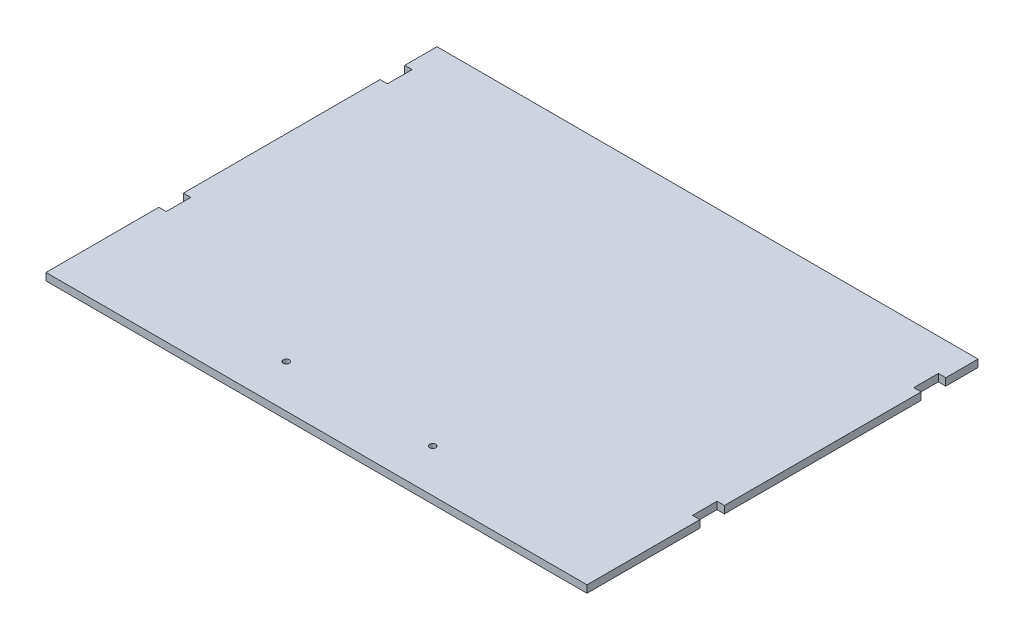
ISO-10303-21;
HEADER;
FILE_DESCRIPTION(('STEP AP214'),'2;1');
FILE_NAME('part.step','',(''),(''),'','','');
FILE_SCHEMA(('AUTOMOTIVE_DESIGN { 1 0 10303 214 1 1 1 1 }'));
ENDSEC;
DATA;
#1=APPLICATION_CONTEXT('core data for automotive mechanical design processes');
#2=APPLICATION_PROTOCOL_DEFINITION('international standard','automotive_design',2000,#1);
#3=PRODUCT_CONTEXT('',#1,'mechanical');
#4=PRODUCT('Part','Part','',(#3));
#5=PRODUCT_RELATED_PRODUCT_CATEGORY('part','',(#4));
#6=PRODUCT_DEFINITION_FORMATION('','',#4);
#7=PRODUCT_DEFINITION_CONTEXT('part definition',#1,'design');
#8=PRODUCT_DEFINITION('design','',#6,#7);
#9=PRODUCT_DEFINITION_SHAPE('','',#8);
#10=(LENGTH_UNIT() NAMED_UNIT(*) SI_UNIT(.MILLI.,.METRE.));
#11=(NAMED_UNIT(*) PLANE_ANGLE_UNIT() SI_UNIT($,.RADIAN.));
#12=(NAMED_UNIT(*) SI_UNIT($,.STERADIAN.) SOLID_ANGLE_UNIT());
#13=UNCERTAINTY_MEASURE_WITH_UNIT(LENGTH_MEASURE(1.E-05),#10,'distance_accuracy_value','');
#14=(GEOMETRIC_REPRESENTATION_CONTEXT(3) GLOBAL_UNCERTAINTY_ASSIGNED_CONTEXT((#13)) GLOBAL_UNIT_ASSIGNED_CONTEXT((#10,
#11,#12)) REPRESENTATION_CONTEXT('',''));
#15=CARTESIAN_POINT('',(0.,0.,0.));
#16=DIRECTION('',(0.,0.,1.));
#17=DIRECTION('',(1.,0.,0.));
#18=AXIS2_PLACEMENT_3D('',#15,#16,#17);
#19=CARTESIAN_POINT('',(0.,6.,0.));
#20=DIRECTION('',(0.,1.,0.));
#21=DIRECTION('',(0.,0.,1.));
#22=AXIS2_PLACEMENT_3D('',#19,#20,#21);
#23=PLANE('',#22);
#24=CARTESIAN_POINT('',(-59.5,6.,124.));
#25=DIRECTION('',(0.,1.,0.));
#26=DIRECTION('',(0.,0.,1.));
#27=AXIS2_PLACEMENT_3D('',#24,#25,#26);
#28=CIRCLE('',#27,2.5);
#29=CARTESIAN_POINT('',(-59.5,6.,126.5));
#30=VERTEX_POINT('',#29);
#31=EDGE_CURVE('E206',#30,#30,#28,.T.);
#32=ORIENTED_EDGE('',*,*,#31,.F.);
#33=EDGE_LOOP('',(#32));
#34=FACE_BOUND('',#33,.T.);
#35=DIRECTION('',(0.,0.,1.));
#36=VECTOR('',#35,1.);
#37=CARTESIAN_POINT('',(-220.,6.,-159.));
#38=LINE('',#37,#36);
#39=CARTESIAN_POINT('',(-220.,6.,-159.));
#40=VERTEX_POINT('',#39);
#41=CARTESIAN_POINT('',(-220.,6.,-132.75));
#42=VERTEX_POINT('',#41);
#43=EDGE_CURVE('E241',#40,#42,#38,.T.);
#44=ORIENTED_EDGE('',*,*,#43,.T.);
#45=DIRECTION('',(1.,0.,0.));
#46=VECTOR('',#45,1.);
#47=CARTESIAN_POINT('',(-220.,6.,-132.75));
#48=LINE('',#47,#46);
#49=CARTESIAN_POINT('',(-214.,6.,-132.75));
#50=VERTEX_POINT('',#49);
#51=EDGE_CURVE('E129',#42,#50,#48,.T.);
#52=ORIENTED_EDGE('',*,*,#51,.T.);
#53=DIRECTION('',(0.,0.,1.));
#54=VECTOR('',#53,1.);
#55=CARTESIAN_POINT('',(-214.,6.,-132.75));
#56=LINE('',#55,#54);
#57=CARTESIAN_POINT('',(-214.,6.,-112.75));
#58=VERTEX_POINT('',#57);
#59=EDGE_CURVE('E292',#50,#58,#56,.T.);
#60=ORIENTED_EDGE('',*,*,#59,.T.);
#61=DIRECTION('',(-1.,0.,0.));
#62=VECTOR('',#61,1.);
#63=CARTESIAN_POINT('',(-220.,6.,-112.75));
#64=LINE('',#63,#62);
#65=CARTESIAN_POINT('',(-220.,6.,-112.75));
#66=VERTEX_POINT('',#65);
#67=EDGE_CURVE('E311',#58,#66,#64,.T.);
#68=ORIENTED_EDGE('',*,*,#67,.T.);
#69=DIRECTION('',(0.,0.,1.));
#70=VECTOR('',#69,1.);
#71=CARTESIAN_POINT('',(-220.,6.,-112.75));
#72=LINE('',#71,#70);
#73=CARTESIAN_POINT('',(-220.,6.,47.25));
#74=VERTEX_POINT('',#73);
#75=EDGE_CURVE('E308',#66,#74,#72,.T.);
#76=ORIENTED_EDGE('',*,*,#75,.T.);
#77=DIRECTION('',(1.,0.,0.));
#78=VECTOR('',#77,1.);
#79=CARTESIAN_POINT('',(-220.,6.,47.25));
#80=LINE('',#79,#78);
#81=CARTESIAN_POINT('',(-214.,6.,47.25));
#82=VERTEX_POINT('',#81);
#83=EDGE_CURVE('E310',#74,#82,#80,.T.);
#84=ORIENTED_EDGE('',*,*,#83,.T.);
#85=DIRECTION('',(0.,0.,1.));
#86=VECTOR('',#85,1.);
#87=CARTESIAN_POINT('',(-214.,6.,47.25));
#88=LINE('',#87,#86);
#89=CARTESIAN_POINT('',(-214.,6.,67.25));
#90=VERTEX_POINT('',#89);
#91=EDGE_CURVE('E313',#82,#90,#88,.T.);
#92=ORIENTED_EDGE('',*,*,#91,.T.);
#93=DIRECTION('',(-1.,0.,0.));
#94=VECTOR('',#93,1.);
#95=CARTESIAN_POINT('',(-220.,6.,67.25));
#96=LINE('',#95,#94);
#97=CARTESIAN_POINT('',(-220.,6.,67.25));
#98=VERTEX_POINT('',#97);
#99=EDGE_CURVE('E319',#90,#98,#96,.T.);
#100=ORIENTED_EDGE('',*,*,#99,.T.);
#101=DIRECTION('',(0.,0.,1.));
#102=VECTOR('',#101,1.);
#103=CARTESIAN_POINT('',(-220.,6.,67.25));
#104=LINE('',#103,#102);
#105=CARTESIAN_POINT('',(-220.,6.,159.));
#106=VERTEX_POINT('',#105);
#107=EDGE_CURVE('E321',#98,#106,#104,.T.);
#108=ORIENTED_EDGE('',*,*,#107,.T.);
#109=DIRECTION('',(1.,0.,0.));
#110=VECTOR('',#109,1.);
#111=CARTESIAN_POINT('',(-220.,6.,159.));
#112=LINE('',#111,#110);
#113=CARTESIAN_POINT('',(220.,6.,159.));
#114=VERTEX_POINT('',#113);
#115=EDGE_CURVE('E323',#106,#114,#112,.T.);
#116=ORIENTED_EDGE('',*,*,#115,.T.);
#117=DIRECTION('',(0.,0.,-1.));
#118=VECTOR('',#117,1.);
#119=CARTESIAN_POINT('',(220.,6.,67.25));
#120=LINE('',#119,#118);
#121=CARTESIAN_POINT('',(220.,6.,67.25));
#122=VERTEX_POINT('',#121);
#123=EDGE_CURVE('E325',#114,#122,#120,.T.);
#124=ORIENTED_EDGE('',*,*,#123,.T.);
#125=DIRECTION('',(-1.,0.,0.));
#126=VECTOR('',#125,1.);
#127=CARTESIAN_POINT('',(220.,6.,67.25));
#128=LINE('',#127,#126);
#129=CARTESIAN_POINT('',(214.,6.,67.25));
#130=VERTEX_POINT('',#129);
#131=EDGE_CURVE('E327',#122,#130,#128,.T.);
#132=ORIENTED_EDGE('',*,*,#131,.T.);
#133=DIRECTION('',(0.,0.,-1.));
#134=VECTOR('',#133,1.);
#135=CARTESIAN_POINT('',(214.,6.,47.25));
#136=LINE('',#135,#134);
#137=CARTESIAN_POINT('',(214.,6.,47.25));
#138=VERTEX_POINT('',#137);
#139=EDGE_CURVE('E329',#130,#138,#136,.T.);
#140=ORIENTED_EDGE('',*,*,#139,.T.);
#141=DIRECTION('',(1.,0.,0.));
#142=VECTOR('',#141,1.);
#143=CARTESIAN_POINT('',(220.,6.,47.25));
#144=LINE('',#143,#142);
#145=CARTESIAN_POINT('',(220.,6.,47.25));
#146=VERTEX_POINT('',#145);
#147=EDGE_CURVE('E331',#138,#146,#144,.T.);
#148=ORIENTED_EDGE('',*,*,#147,.T.);
#149=DIRECTION('',(0.,0.,-1.));
#150=VECTOR('',#149,1.);
#151=CARTESIAN_POINT('',(220.,6.,-112.75));
#152=LINE('',#151,#150);
#153=CARTESIAN_POINT('',(220.,6.,-112.75));
#154=VERTEX_POINT('',#153);
#155=EDGE_CURVE('E333',#146,#154,#152,.T.);
#156=ORIENTED_EDGE('',*,*,#155,.T.);
#157=DIRECTION('',(-1.,0.,0.));
#158=VECTOR('',#157,1.);
#159=CARTESIAN_POINT('',(220.,6.,-112.75));
#160=LINE('',#159,#158);
#161=CARTESIAN_POINT('',(214.,6.,-112.75));
#162=VERTEX_POINT('',#161);
#163=EDGE_CURVE('E335',#154,#162,#160,.T.);
#164=ORIENTED_EDGE('',*,*,#163,.T.);
#165=DIRECTION('',(0.,0.,-1.));
#166=VECTOR('',#165,1.);
#167=CARTESIAN_POINT('',(214.,6.,-132.75));
#168=LINE('',#167,#166);
#169=CARTESIAN_POINT('',(214.,6.,-132.75));
#170=VERTEX_POINT('',#169);
#171=EDGE_CURVE('E184',#162,#170,#168,.T.);
#172=ORIENTED_EDGE('',*,*,#171,.T.);
#173=DIRECTION('',(1.,0.,0.));
#174=VECTOR('',#173,1.);
#175=CARTESIAN_POINT('',(220.,6.,-132.75));
#176=LINE('',#175,#174);
#177=CARTESIAN_POINT('',(220.,6.,-132.75));
#178=VERTEX_POINT('',#177);
#179=EDGE_CURVE('E178',#170,#178,#176,.T.);
#180=ORIENTED_EDGE('',*,*,#179,.T.);
#181=DIRECTION('',(0.,0.,-1.));
#182=VECTOR('',#181,1.);
#183=CARTESIAN_POINT('',(220.,6.,-159.));
#184=LINE('',#183,#182);
#185=CARTESIAN_POINT('',(220.,6.,-159.));
#186=VERTEX_POINT('',#185);
#187=EDGE_CURVE('E182',#178,#186,#184,.T.);
#188=ORIENTED_EDGE('',*,*,#187,.T.);
#189=DIRECTION('',(-1.,0.,0.));
#190=VECTOR('',#189,1.);
#191=CARTESIAN_POINT('',(-220.,6.,-159.));
#192=LINE('',#191,#190);
#193=EDGE_CURVE('E50',#186,#40,#192,.T.);
#194=ORIENTED_EDGE('',*,*,#193,.T.);
#195=EDGE_LOOP('',(#44,#52,#60,#68,#76,#84,#92,#100,#108,#116,#124,#132,#140,#148,#156,#164,
#172,#180,#188,#194));
#196=FACE_BOUND('',#195,.T.);
#197=CARTESIAN_POINT('',(59.5,6.,124.));
#198=DIRECTION('',(0.,1.,0.));
#199=DIRECTION('',(0.,0.,-1.));
#200=AXIS2_PLACEMENT_3D('',#197,#198,#199);
#201=CIRCLE('',#200,2.5);
#202=CARTESIAN_POINT('',(59.5,6.,121.5));
#203=VERTEX_POINT('',#202);
#204=EDGE_CURVE('E378',#203,#203,#201,.T.);
#205=ORIENTED_EDGE('',*,*,#204,.F.);
#206=EDGE_LOOP('',(#205));
#207=FACE_BOUND('',#206,.T.);
#208=ADVANCED_FACE('F33',(#34,#196,#207),#23,.T.);
#209=CARTESIAN_POINT('',(0.,0.,0.));
#210=DIRECTION('',(0.,1.,0.));
#211=DIRECTION('',(0.,0.,1.));
#212=AXIS2_PLACEMENT_3D('',#209,#210,#211);
#213=PLANE('',#212);
#214=CARTESIAN_POINT('',(-59.5,0.,124.));
#215=DIRECTION('',(0.,1.,0.));
#216=DIRECTION('',(0.,0.,1.));
#217=AXIS2_PLACEMENT_3D('',#214,#215,#216);
#218=CIRCLE('',#217,2.5);
#219=CARTESIAN_POINT('',(-59.5,0.,126.5));
#220=VERTEX_POINT('',#219);
#221=EDGE_CURVE('E383',#220,#220,#218,.T.);
#222=ORIENTED_EDGE('',*,*,#221,.T.);
#223=EDGE_LOOP('',(#222));
#224=FACE_BOUND('',#223,.T.);
#225=DIRECTION('',(0.,0.,1.));
#226=VECTOR('',#225,1.);
#227=CARTESIAN_POINT('',(-220.,0.,-159.));
#228=LINE('',#227,#226);
#229=CARTESIAN_POINT('',(-220.,0.,-159.));
#230=VERTEX_POINT('',#229);
#231=CARTESIAN_POINT('',(-220.,0.,-132.75));
#232=VERTEX_POINT('',#231);
#233=EDGE_CURVE('E202',#230,#232,#228,.T.);
#234=ORIENTED_EDGE('',*,*,#233,.F.);
#235=DIRECTION('',(-1.,0.,0.));
#236=VECTOR('',#235,1.);
#237=CARTESIAN_POINT('',(-220.,0.,-159.));
#238=LINE('',#237,#236);
#239=CARTESIAN_POINT('',(220.,0.,-159.));
#240=VERTEX_POINT('',#239);
#241=EDGE_CURVE('E121',#240,#230,#238,.T.);
#242=ORIENTED_EDGE('',*,*,#241,.F.);
#243=DIRECTION('',(0.,0.,-1.));
#244=VECTOR('',#243,1.);
#245=CARTESIAN_POINT('',(220.,0.,-159.));
#246=LINE('',#245,#244);
#247=CARTESIAN_POINT('',(220.,0.,-132.75));
#248=VERTEX_POINT('',#247);
#249=EDGE_CURVE('E115',#248,#240,#246,.T.);
#250=ORIENTED_EDGE('',*,*,#249,.F.);
#251=DIRECTION('',(1.,0.,0.));
#252=VECTOR('',#251,1.);
#253=CARTESIAN_POINT('',(220.,0.,-132.75));
#254=LINE('',#253,#252);
#255=CARTESIAN_POINT('',(214.,0.,-132.75));
#256=VERTEX_POINT('',#255);
#257=EDGE_CURVE('E192',#256,#248,#254,.T.);
#258=ORIENTED_EDGE('',*,*,#257,.F.);
#259=DIRECTION('',(0.,0.,-1.));
#260=VECTOR('',#259,1.);
#261=CARTESIAN_POINT('',(214.,0.,-132.75));
#262=LINE('',#261,#260);
#263=CARTESIAN_POINT('',(214.,0.,-112.75));
#264=VERTEX_POINT('',#263);
#265=EDGE_CURVE('E236',#264,#256,#262,.T.);
#266=ORIENTED_EDGE('',*,*,#265,.F.);
#267=DIRECTION('',(-1.,0.,0.));
#268=VECTOR('',#267,1.);
#269=CARTESIAN_POINT('',(220.,0.,-112.75));
#270=LINE('',#269,#268);
#271=CARTESIAN_POINT('',(220.,0.,-112.75));
#272=VERTEX_POINT('',#271);
#273=EDGE_CURVE('E234',#272,#264,#270,.T.);
#274=ORIENTED_EDGE('',*,*,#273,.F.);
#275=DIRECTION('',(0.,0.,-1.));
#276=VECTOR('',#275,1.);
#277=CARTESIAN_POINT('',(220.,0.,-112.75));
#278=LINE('',#277,#276);
#279=CARTESIAN_POINT('',(220.,0.,47.25));
#280=VERTEX_POINT('',#279);
#281=EDGE_CURVE('E232',#280,#272,#278,.T.);
#282=ORIENTED_EDGE('',*,*,#281,.F.);
#283=DIRECTION('',(1.,0.,0.));
#284=VECTOR('',#283,1.);
#285=CARTESIAN_POINT('',(220.,0.,47.25));
#286=LINE('',#285,#284);
#287=CARTESIAN_POINT('',(214.,0.,47.25));
#288=VERTEX_POINT('',#287);
#289=EDGE_CURVE('E230',#288,#280,#286,.T.);
#290=ORIENTED_EDGE('',*,*,#289,.F.);
#291=DIRECTION('',(0.,0.,-1.));
#292=VECTOR('',#291,1.);
#293=CARTESIAN_POINT('',(214.,0.,47.25));
#294=LINE('',#293,#292);
#295=CARTESIAN_POINT('',(214.,0.,67.25));
#296=VERTEX_POINT('',#295);
#297=EDGE_CURVE('E228',#296,#288,#294,.T.);
#298=ORIENTED_EDGE('',*,*,#297,.F.);
#299=DIRECTION('',(-1.,0.,0.));
#300=VECTOR('',#299,1.);
#301=CARTESIAN_POINT('',(220.,0.,67.25));
#302=LINE('',#301,#300);
#303=CARTESIAN_POINT('',(220.,0.,67.25));
#304=VERTEX_POINT('',#303);
#305=EDGE_CURVE('E226',#304,#296,#302,.T.);
#306=ORIENTED_EDGE('',*,*,#305,.F.);
#307=DIRECTION('',(0.,0.,-1.));
#308=VECTOR('',#307,1.);
#309=CARTESIAN_POINT('',(220.,0.,67.25));
#310=LINE('',#309,#308);
#311=CARTESIAN_POINT('',(220.,0.,159.));
#312=VERTEX_POINT('',#311);
#313=EDGE_CURVE('E224',#312,#304,#310,.T.);
#314=ORIENTED_EDGE('',*,*,#313,.F.);
#315=DIRECTION('',(1.,0.,0.));
#316=VECTOR('',#315,1.);
#317=CARTESIAN_POINT('',(-220.,0.,159.));
#318=LINE('',#317,#316);
#319=CARTESIAN_POINT('',(-220.,0.,159.));
#320=VERTEX_POINT('',#319);
#321=EDGE_CURVE('E222',#320,#312,#318,.T.);
#322=ORIENTED_EDGE('',*,*,#321,.F.);
#323=DIRECTION('',(0.,0.,1.));
#324=VECTOR('',#323,1.);
#325=CARTESIAN_POINT('',(-220.,0.,67.25));
#326=LINE('',#325,#324);
#327=CARTESIAN_POINT('',(-220.,0.,67.25));
#328=VERTEX_POINT('',#327);
#329=EDGE_CURVE('E220',#328,#320,#326,.T.);
#330=ORIENTED_EDGE('',*,*,#329,.F.);
#331=DIRECTION('',(-1.,0.,0.));
#332=VECTOR('',#331,1.);
#333=CARTESIAN_POINT('',(-220.,0.,67.25));
#334=LINE('',#333,#332);
#335=CARTESIAN_POINT('',(-214.,0.,67.25));
#336=VERTEX_POINT('',#335);
#337=EDGE_CURVE('E218',#336,#328,#334,.T.);
#338=ORIENTED_EDGE('',*,*,#337,.F.);
#339=DIRECTION('',(0.,0.,1.));
#340=VECTOR('',#339,1.);
#341=CARTESIAN_POINT('',(-214.,0.,47.25));
#342=LINE('',#341,#340);
#343=CARTESIAN_POINT('',(-214.,0.,47.25));
#344=VERTEX_POINT('',#343);
#345=EDGE_CURVE('E216',#344,#336,#342,.T.);
#346=ORIENTED_EDGE('',*,*,#345,.F.);
#347=DIRECTION('',(1.,0.,0.));
#348=VECTOR('',#347,1.);
#349=CARTESIAN_POINT('',(-220.,0.,47.25));
#350=LINE('',#349,#348);
#351=CARTESIAN_POINT('',(-220.,0.,47.25));
#352=VERTEX_POINT('',#351);
#353=EDGE_CURVE('E214',#352,#344,#350,.T.);
#354=ORIENTED_EDGE('',*,*,#353,.F.);
#355=DIRECTION('',(0.,0.,1.));
#356=VECTOR('',#355,1.);
#357=CARTESIAN_POINT('',(-220.,0.,-112.75));
#358=LINE('',#357,#356);
#359=CARTESIAN_POINT('',(-220.,0.,-112.75));
#360=VERTEX_POINT('',#359);
#361=EDGE_CURVE('E212',#360,#352,#358,.T.);
#362=ORIENTED_EDGE('',*,*,#361,.F.);
#363=DIRECTION('',(-1.,0.,0.));
#364=VECTOR('',#363,1.);
#365=CARTESIAN_POINT('',(-220.,0.,-112.75));
#366=LINE('',#365,#364);
#367=CARTESIAN_POINT('',(-214.,0.,-112.75));
#368=VERTEX_POINT('',#367);
#369=EDGE_CURVE('E210',#368,#360,#366,.T.);
#370=ORIENTED_EDGE('',*,*,#369,.F.);
#371=DIRECTION('',(0.,0.,1.));
#372=VECTOR('',#371,1.);
#373=CARTESIAN_POINT('',(-214.,0.,-132.75));
#374=LINE('',#373,#372);
#375=CARTESIAN_POINT('',(-214.,0.,-132.75));
#376=VERTEX_POINT('',#375);
#377=EDGE_CURVE('E208',#376,#368,#374,.T.);
#378=ORIENTED_EDGE('',*,*,#377,.F.);
#379=DIRECTION('',(1.,0.,0.));
#380=VECTOR('',#379,1.);
#381=CARTESIAN_POINT('',(-220.,0.,-132.75));
#382=LINE('',#381,#380);
#383=EDGE_CURVE('E205',#232,#376,#382,.T.);
#384=ORIENTED_EDGE('',*,*,#383,.F.);
#385=EDGE_LOOP('',(#234,#242,#250,#258,#266,#274,#282,#290,#298,#306,#314,#322,#330,#338,#346,
#354,#362,#370,#378,#384));
#386=FACE_BOUND('',#385,.T.);
#387=CARTESIAN_POINT('',(59.5,0.,124.));
#388=DIRECTION('',(0.,1.,0.));
#389=DIRECTION('',(0.,0.,-1.));
#390=AXIS2_PLACEMENT_3D('',#387,#388,#389);
#391=CIRCLE('',#390,2.5);
#392=CARTESIAN_POINT('',(59.5,0.,121.5));
#393=VERTEX_POINT('',#392);
#394=EDGE_CURVE('E381',#393,#393,#391,.T.);
#395=ORIENTED_EDGE('',*,*,#394,.T.);
#396=EDGE_LOOP('',(#395));
#397=FACE_BOUND('',#396,.T.);
#398=ADVANCED_FACE('F296',(#224,#386,#397),#213,.F.);
#399=CARTESIAN_POINT('',(-220.,6.,-159.));
#400=DIRECTION('',(1.,0.,0.));
#401=DIRECTION('',(0.,0.,-1.));
#402=AXIS2_PLACEMENT_3D('',#399,#400,#401);
#403=PLANE('',#402);
#404=ORIENTED_EDGE('',*,*,#233,.T.);
#405=DIRECTION('',(0.,-1.,0.));
#406=VECTOR('',#405,1.);
#407=CARTESIAN_POINT('',(-220.,6.,-132.75));
#408=LINE('',#407,#406);
#409=EDGE_CURVE('E11',#42,#232,#408,.T.);
#410=ORIENTED_EDGE('',*,*,#409,.F.);
#411=ORIENTED_EDGE('',*,*,#43,.F.);
#412=DIRECTION('',(0.,-1.,0.));
#413=VECTOR('',#412,1.);
#414=CARTESIAN_POINT('',(-220.,6.,-159.));
#415=LINE('',#414,#413);
#416=EDGE_CURVE('E198',#40,#230,#415,.T.);
#417=ORIENTED_EDGE('',*,*,#416,.T.);
#418=EDGE_LOOP('',(#404,#410,#411,#417));
#419=FACE_BOUND('',#418,.T.);
#420=ADVANCED_FACE('F35',(#419),#403,.F.);
#421=CARTESIAN_POINT('',(-220.,6.,-132.75));
#422=DIRECTION('',(0.,0.,-1.));
#423=DIRECTION('',(-1.,0.,0.));
#424=AXIS2_PLACEMENT_3D('',#421,#422,#423);
#425=PLANE('',#424);
#426=ORIENTED_EDGE('',*,*,#383,.T.);
#427=DIRECTION('',(0.,-1.,0.));
#428=VECTOR('',#427,1.);
#429=CARTESIAN_POINT('',(-214.,6.,-132.75));
#430=LINE('',#429,#428);
#431=EDGE_CURVE('E42',#50,#376,#430,.T.);
#432=ORIENTED_EDGE('',*,*,#431,.F.);
#433=ORIENTED_EDGE('',*,*,#51,.F.);
#434=ORIENTED_EDGE('',*,*,#409,.T.);
#435=EDGE_LOOP('',(#426,#432,#433,#434));
#436=FACE_BOUND('',#435,.T.);
#437=ADVANCED_FACE('F556',(#436),#425,.F.);
#438=CARTESIAN_POINT('',(-214.,6.,-132.75));
#439=DIRECTION('',(1.,0.,0.));
#440=DIRECTION('',(0.,0.,-1.));
#441=AXIS2_PLACEMENT_3D('',#438,#439,#440);
#442=PLANE('',#441);
#443=ORIENTED_EDGE('',*,*,#377,.T.);
#444=DIRECTION('',(0.,-1.,0.));
#445=VECTOR('',#444,1.);
#446=CARTESIAN_POINT('',(-214.,6.,-112.75));
#447=LINE('',#446,#445);
#448=EDGE_CURVE('E284',#58,#368,#447,.T.);
#449=ORIENTED_EDGE('',*,*,#448,.F.);
#450=ORIENTED_EDGE('',*,*,#59,.F.);
#451=ORIENTED_EDGE('',*,*,#431,.T.);
#452=EDGE_LOOP('',(#443,#449,#450,#451));
#453=FACE_BOUND('',#452,.T.);
#454=ADVANCED_FACE('F290',(#453),#442,.F.);
#455=CARTESIAN_POINT('',(-220.,6.,-112.75));
#456=DIRECTION('',(0.,0.,1.));
#457=DIRECTION('',(1.,0.,0.));
#458=AXIS2_PLACEMENT_3D('',#455,#456,#457);
#459=PLANE('',#458);
#460=ORIENTED_EDGE('',*,*,#369,.T.);
#461=DIRECTION('',(0.,-1.,0.));
#462=VECTOR('',#461,1.);
#463=CARTESIAN_POINT('',(-220.,6.,-112.75));
#464=LINE('',#463,#462);
#465=EDGE_CURVE('E281',#66,#360,#464,.T.);
#466=ORIENTED_EDGE('',*,*,#465,.F.);
#467=ORIENTED_EDGE('',*,*,#67,.F.);
#468=ORIENTED_EDGE('',*,*,#448,.T.);
#469=EDGE_LOOP('',(#460,#466,#467,#468));
#470=FACE_BOUND('',#469,.T.);
#471=ADVANCED_FACE('F302',(#470),#459,.F.);
#472=CARTESIAN_POINT('',(-220.,6.,-112.75));
#473=DIRECTION('',(1.,0.,0.));
#474=DIRECTION('',(0.,0.,-1.));
#475=AXIS2_PLACEMENT_3D('',#472,#473,#474);
#476=PLANE('',#475);
#477=ORIENTED_EDGE('',*,*,#361,.T.);
#478=DIRECTION('',(0.,-1.,0.));
#479=VECTOR('',#478,1.);
#480=CARTESIAN_POINT('',(-220.,6.,47.25));
#481=LINE('',#480,#479);
#482=EDGE_CURVE('E278',#74,#352,#481,.T.);
#483=ORIENTED_EDGE('',*,*,#482,.F.);
#484=ORIENTED_EDGE('',*,*,#75,.F.);
#485=ORIENTED_EDGE('',*,*,#465,.T.);
#486=EDGE_LOOP('',(#477,#483,#484,#485));
#487=FACE_BOUND('',#486,.T.);
#488=ADVANCED_FACE('F306',(#487),#476,.F.);
#489=CARTESIAN_POINT('',(-220.,6.,47.25));
#490=DIRECTION('',(0.,0.,-1.));
#491=DIRECTION('',(-1.,0.,0.));
#492=AXIS2_PLACEMENT_3D('',#489,#490,#491);
#493=PLANE('',#492);
#494=ORIENTED_EDGE('',*,*,#353,.T.);
#495=DIRECTION('',(0.,-1.,0.));
#496=VECTOR('',#495,1.);
#497=CARTESIAN_POINT('',(-214.,6.,47.25));
#498=LINE('',#497,#496);
#499=EDGE_CURVE('E275',#82,#344,#498,.T.);
#500=ORIENTED_EDGE('',*,*,#499,.F.);
#501=ORIENTED_EDGE('',*,*,#83,.F.);
#502=ORIENTED_EDGE('',*,*,#482,.T.);
#503=EDGE_LOOP('',(#494,#500,#501,#502));
#504=FACE_BOUND('',#503,.T.);
#505=ADVANCED_FACE('F521',(#504),#493,.F.);
#506=CARTESIAN_POINT('',(-214.,6.,47.25));
#507=DIRECTION('',(1.,0.,0.));
#508=DIRECTION('',(0.,0.,-1.));
#509=AXIS2_PLACEMENT_3D('',#506,#507,#508);
#510=PLANE('',#509);
#511=ORIENTED_EDGE('',*,*,#345,.T.);
#512=DIRECTION('',(0.,-1.,0.));
#513=VECTOR('',#512,1.);
#514=CARTESIAN_POINT('',(-214.,6.,67.25));
#515=LINE('',#514,#513);
#516=EDGE_CURVE('E272',#90,#336,#515,.T.);
#517=ORIENTED_EDGE('',*,*,#516,.F.);
#518=ORIENTED_EDGE('',*,*,#91,.F.);
#519=ORIENTED_EDGE('',*,*,#499,.T.);
#520=EDGE_LOOP('',(#511,#517,#518,#519));
#521=FACE_BOUND('',#520,.T.);
#522=ADVANCED_FACE('F511',(#521),#510,.F.);
#523=CARTESIAN_POINT('',(-220.,6.,67.25));
#524=DIRECTION('',(0.,0.,1.));
#525=DIRECTION('',(1.,0.,0.));
#526=AXIS2_PLACEMENT_3D('',#523,#524,#525);
#527=PLANE('',#526);
#528=ORIENTED_EDGE('',*,*,#337,.T.);
#529=DIRECTION('',(0.,-1.,0.));
#530=VECTOR('',#529,1.);
#531=CARTESIAN_POINT('',(-220.,6.,67.25));
#532=LINE('',#531,#530);
#533=EDGE_CURVE('E269',#98,#328,#532,.T.);
#534=ORIENTED_EDGE('',*,*,#533,.F.);
#535=ORIENTED_EDGE('',*,*,#99,.F.);
#536=ORIENTED_EDGE('',*,*,#516,.T.);
#537=EDGE_LOOP('',(#528,#534,#535,#536));
#538=FACE_BOUND('',#537,.T.);
#539=ADVANCED_FACE('F501',(#538),#527,.F.);
#540=CARTESIAN_POINT('',(-220.,6.,67.25));
#541=DIRECTION('',(1.,0.,0.));
#542=DIRECTION('',(0.,0.,-1.));
#543=AXIS2_PLACEMENT_3D('',#540,#541,#542);
#544=PLANE('',#543);
#545=ORIENTED_EDGE('',*,*,#329,.T.);
#546=DIRECTION('',(0.,-1.,0.));
#547=VECTOR('',#546,1.);
#548=CARTESIAN_POINT('',(-220.,6.,159.));
#549=LINE('',#548,#547);
#550=EDGE_CURVE('E266',#106,#320,#549,.T.);
#551=ORIENTED_EDGE('',*,*,#550,.F.);
#552=ORIENTED_EDGE('',*,*,#107,.F.);
#553=ORIENTED_EDGE('',*,*,#533,.T.);
#554=EDGE_LOOP('',(#545,#551,#552,#553));
#555=FACE_BOUND('',#554,.T.);
#556=ADVANCED_FACE('F491',(#555),#544,.F.);
#557=CARTESIAN_POINT('',(-220.,6.,159.));
#558=DIRECTION('',(0.,0.,-1.));
#559=DIRECTION('',(-1.,0.,0.));
#560=AXIS2_PLACEMENT_3D('',#557,#558,#559);
#561=PLANE('',#560);
#562=ORIENTED_EDGE('',*,*,#321,.T.);
#563=DIRECTION('',(0.,-1.,0.));
#564=VECTOR('',#563,1.);
#565=CARTESIAN_POINT('',(220.,6.,159.));
#566=LINE('',#565,#564);
#567=EDGE_CURVE('E263',#114,#312,#566,.T.);
#568=ORIENTED_EDGE('',*,*,#567,.F.);
#569=ORIENTED_EDGE('',*,*,#115,.F.);
#570=ORIENTED_EDGE('',*,*,#550,.T.);
#571=EDGE_LOOP('',(#562,#568,#569,#570));
#572=FACE_BOUND('',#571,.T.);
#573=ADVANCED_FACE('F481',(#572),#561,.F.);
#574=CARTESIAN_POINT('',(220.,6.,67.25));
#575=DIRECTION('',(-1.,0.,0.));
#576=DIRECTION('',(0.,0.,1.));
#577=AXIS2_PLACEMENT_3D('',#574,#575,#576);
#578=PLANE('',#577);
#579=ORIENTED_EDGE('',*,*,#313,.T.);
#580=DIRECTION('',(0.,-1.,0.));
#581=VECTOR('',#580,1.);
#582=CARTESIAN_POINT('',(220.,6.,67.25));
#583=LINE('',#582,#581);
#584=EDGE_CURVE('E260',#122,#304,#583,.T.);
#585=ORIENTED_EDGE('',*,*,#584,.F.);
#586=ORIENTED_EDGE('',*,*,#123,.F.);
#587=ORIENTED_EDGE('',*,*,#567,.T.);
#588=EDGE_LOOP('',(#579,#585,#586,#587));
#589=FACE_BOUND('',#588,.T.);
#590=ADVANCED_FACE('F471',(#589),#578,.F.);
#591=CARTESIAN_POINT('',(220.,6.,67.25));
#592=DIRECTION('',(0.,0.,1.));
#593=DIRECTION('',(1.,0.,0.));
#594=AXIS2_PLACEMENT_3D('',#591,#592,#593);
#595=PLANE('',#594);
#596=ORIENTED_EDGE('',*,*,#305,.T.);
#597=DIRECTION('',(0.,-1.,0.));
#598=VECTOR('',#597,1.);
#599=CARTESIAN_POINT('',(214.,6.,67.25));
#600=LINE('',#599,#598);
#601=EDGE_CURVE('E257',#130,#296,#600,.T.);
#602=ORIENTED_EDGE('',*,*,#601,.F.);
#603=ORIENTED_EDGE('',*,*,#131,.F.);
#604=ORIENTED_EDGE('',*,*,#584,.T.);
#605=EDGE_LOOP('',(#596,#602,#603,#604));
#606=FACE_BOUND('',#605,.T.);
#607=ADVANCED_FACE('F461',(#606),#595,.F.);
#608=CARTESIAN_POINT('',(214.,6.,47.25));
#609=DIRECTION('',(-1.,0.,0.));
#610=DIRECTION('',(0.,0.,1.));
#611=AXIS2_PLACEMENT_3D('',#608,#609,#610);
#612=PLANE('',#611);
#613=ORIENTED_EDGE('',*,*,#297,.T.);
#614=DIRECTION('',(0.,-1.,0.));
#615=VECTOR('',#614,1.);
#616=CARTESIAN_POINT('',(214.,6.,47.25));
#617=LINE('',#616,#615);
#618=EDGE_CURVE('E254',#138,#288,#617,.T.);
#619=ORIENTED_EDGE('',*,*,#618,.F.);
#620=ORIENTED_EDGE('',*,*,#139,.F.);
#621=ORIENTED_EDGE('',*,*,#601,.T.);
#622=EDGE_LOOP('',(#613,#619,#620,#621));
#623=FACE_BOUND('',#622,.T.);
#624=ADVANCED_FACE('F451',(#623),#612,.F.);
#625=CARTESIAN_POINT('',(220.,6.,47.25));
#626=DIRECTION('',(0.,0.,-1.));
#627=DIRECTION('',(-1.,0.,0.));
#628=AXIS2_PLACEMENT_3D('',#625,#626,#627);
#629=PLANE('',#628);
#630=ORIENTED_EDGE('',*,*,#289,.T.);
#631=DIRECTION('',(0.,-1.,0.));
#632=VECTOR('',#631,1.);
#633=CARTESIAN_POINT('',(220.,6.,47.25));
#634=LINE('',#633,#632);
#635=EDGE_CURVE('E251',#146,#280,#634,.T.);
#636=ORIENTED_EDGE('',*,*,#635,.F.);
#637=ORIENTED_EDGE('',*,*,#147,.F.);
#638=ORIENTED_EDGE('',*,*,#618,.T.);
#639=EDGE_LOOP('',(#630,#636,#637,#638));
#640=FACE_BOUND('',#639,.T.);
#641=ADVANCED_FACE('F441',(#640),#629,.F.);
#642=CARTESIAN_POINT('',(220.,6.,-112.75));
#643=DIRECTION('',(-1.,0.,0.));
#644=DIRECTION('',(0.,0.,1.));
#645=AXIS2_PLACEMENT_3D('',#642,#643,#644);
#646=PLANE('',#645);
#647=ORIENTED_EDGE('',*,*,#281,.T.);
#648=DIRECTION('',(0.,-1.,0.));
#649=VECTOR('',#648,1.);
#650=CARTESIAN_POINT('',(220.,6.,-112.75));
#651=LINE('',#650,#649);
#652=EDGE_CURVE('E248',#154,#272,#651,.T.);
#653=ORIENTED_EDGE('',*,*,#652,.F.);
#654=ORIENTED_EDGE('',*,*,#155,.F.);
#655=ORIENTED_EDGE('',*,*,#635,.T.);
#656=EDGE_LOOP('',(#647,#653,#654,#655));
#657=FACE_BOUND('',#656,.T.);
#658=ADVANCED_FACE('F432',(#657),#646,.F.);
#659=CARTESIAN_POINT('',(220.,6.,-112.75));
#660=DIRECTION('',(0.,0.,1.));
#661=DIRECTION('',(1.,0.,0.));
#662=AXIS2_PLACEMENT_3D('',#659,#660,#661);
#663=PLANE('',#662);
#664=ORIENTED_EDGE('',*,*,#273,.T.);
#665=DIRECTION('',(0.,-1.,0.));
#666=VECTOR('',#665,1.);
#667=CARTESIAN_POINT('',(214.,6.,-112.75));
#668=LINE('',#667,#666);
#669=EDGE_CURVE('E245',#162,#264,#668,.T.);
#670=ORIENTED_EDGE('',*,*,#669,.F.);
#671=ORIENTED_EDGE('',*,*,#163,.F.);
#672=ORIENTED_EDGE('',*,*,#652,.T.);
#673=EDGE_LOOP('',(#664,#670,#671,#672));
#674=FACE_BOUND('',#673,.T.);
#675=ADVANCED_FACE('F341',(#674),#663,.F.);
#676=CARTESIAN_POINT('',(214.,6.,-132.75));
#677=DIRECTION('',(-1.,0.,0.));
#678=DIRECTION('',(0.,0.,1.));
#679=AXIS2_PLACEMENT_3D('',#676,#677,#678);
#680=PLANE('',#679);
#681=ORIENTED_EDGE('',*,*,#265,.T.);
#682=DIRECTION('',(0.,-1.,0.));
#683=VECTOR('',#682,1.);
#684=CARTESIAN_POINT('',(214.,6.,-132.75));
#685=LINE('',#684,#683);
#686=EDGE_CURVE('E193',#170,#256,#685,.T.);
#687=ORIENTED_EDGE('',*,*,#686,.F.);
#688=ORIENTED_EDGE('',*,*,#171,.F.);
#689=ORIENTED_EDGE('',*,*,#669,.T.);
#690=EDGE_LOOP('',(#681,#687,#688,#689));
#691=FACE_BOUND('',#690,.T.);
#692=ADVANCED_FACE('F345',(#691),#680,.F.);
#693=CARTESIAN_POINT('',(220.,6.,-132.75));
#694=DIRECTION('',(0.,0.,-1.));
#695=DIRECTION('',(-1.,0.,0.));
#696=AXIS2_PLACEMENT_3D('',#693,#694,#695);
#697=PLANE('',#696);
#698=ORIENTED_EDGE('',*,*,#257,.T.);
#699=DIRECTION('',(0.,-1.,0.));
#700=VECTOR('',#699,1.);
#701=CARTESIAN_POINT('',(220.,6.,-132.75));
#702=LINE('',#701,#700);
#703=EDGE_CURVE('E189',#178,#248,#702,.T.);
#704=ORIENTED_EDGE('',*,*,#703,.F.);
#705=ORIENTED_EDGE('',*,*,#179,.F.);
#706=ORIENTED_EDGE('',*,*,#686,.T.);
#707=EDGE_LOOP('',(#698,#704,#705,#706));
#708=FACE_BOUND('',#707,.T.);
#709=ADVANCED_FACE('F190',(#708),#697,.F.);
#710=CARTESIAN_POINT('',(220.,6.,-159.));
#711=DIRECTION('',(-1.,0.,0.));
#712=DIRECTION('',(0.,0.,1.));
#713=AXIS2_PLACEMENT_3D('',#710,#711,#712);
#714=PLANE('',#713);
#715=ORIENTED_EDGE('',*,*,#249,.T.);
#716=DIRECTION('',(0.,-1.,0.));
#717=VECTOR('',#716,1.);
#718=CARTESIAN_POINT('',(220.,6.,-159.));
#719=LINE('',#718,#717);
#720=EDGE_CURVE('E194',#186,#240,#719,.T.);
#721=ORIENTED_EDGE('',*,*,#720,.F.);
#722=ORIENTED_EDGE('',*,*,#187,.F.);
#723=ORIENTED_EDGE('',*,*,#703,.T.);
#724=EDGE_LOOP('',(#715,#721,#722,#723));
#725=FACE_BOUND('',#724,.T.);
#726=ADVANCED_FACE('F196',(#725),#714,.F.);
#727=CARTESIAN_POINT('',(-220.,6.,-159.));
#728=DIRECTION('',(0.,0.,1.));
#729=DIRECTION('',(1.,0.,0.));
#730=AXIS2_PLACEMENT_3D('',#727,#728,#729);
#731=PLANE('',#730);
#732=ORIENTED_EDGE('',*,*,#241,.T.);
#733=ORIENTED_EDGE('',*,*,#416,.F.);
#734=ORIENTED_EDGE('',*,*,#193,.F.);
#735=ORIENTED_EDGE('',*,*,#720,.T.);
#736=EDGE_LOOP('',(#732,#733,#734,#735));
#737=FACE_BOUND('',#736,.T.);
#738=ADVANCED_FACE('F349',(#737),#731,.F.);
#739=CARTESIAN_POINT('',(-59.5,6.,124.));
#740=DIRECTION('',(0.,-1.,0.));
#741=DIRECTION('',(0.,0.,-1.));
#742=AXIS2_PLACEMENT_3D('',#739,#740,#741);
#743=CYLINDRICAL_SURFACE('',#742,2.5);
#744=ORIENTED_EDGE('',*,*,#31,.T.);
#745=EDGE_LOOP('',(#744));
#746=FACE_BOUND('',#745,.T.);
#747=ORIENTED_EDGE('',*,*,#221,.F.);
#748=EDGE_LOOP('',(#747));
#749=FACE_BOUND('',#748,.T.);
#750=ADVANCED_FACE('F351',(#746,#749),#743,.F.);
#751=CARTESIAN_POINT('',(59.5,6.,124.));
#752=DIRECTION('',(0.,-1.,0.));
#753=DIRECTION('',(0.,0.,-1.));
#754=AXIS2_PLACEMENT_3D('',#751,#752,#753);
#755=CYLINDRICAL_SURFACE('',#754,2.5);
#756=ORIENTED_EDGE('',*,*,#204,.T.);
#757=EDGE_LOOP('',(#756));
#758=FACE_BOUND('',#757,.T.);
#759=ORIENTED_EDGE('',*,*,#394,.F.);
#760=EDGE_LOOP('',(#759));
#761=FACE_BOUND('',#760,.T.);
#762=ADVANCED_FACE('F357',(#758,#761),#755,.F.);
#763=CLOSED_SHELL('',(#208,#398,#420,#437,#454,#471,#488,#505,#522,#539,#556,#573,#590,#607,
#624,#641,#658,#675,#692,#709,#726,#738,#750,#762));
#764=MANIFOLD_SOLID_BREP('B2',#763);
#765=ADVANCED_BREP_SHAPE_REPRESENTATION('',(#18,#764),#14);
#766=SHAPE_DEFINITION_REPRESENTATION(#9,#765);
ENDSEC;
END-ISO-10303-21;
